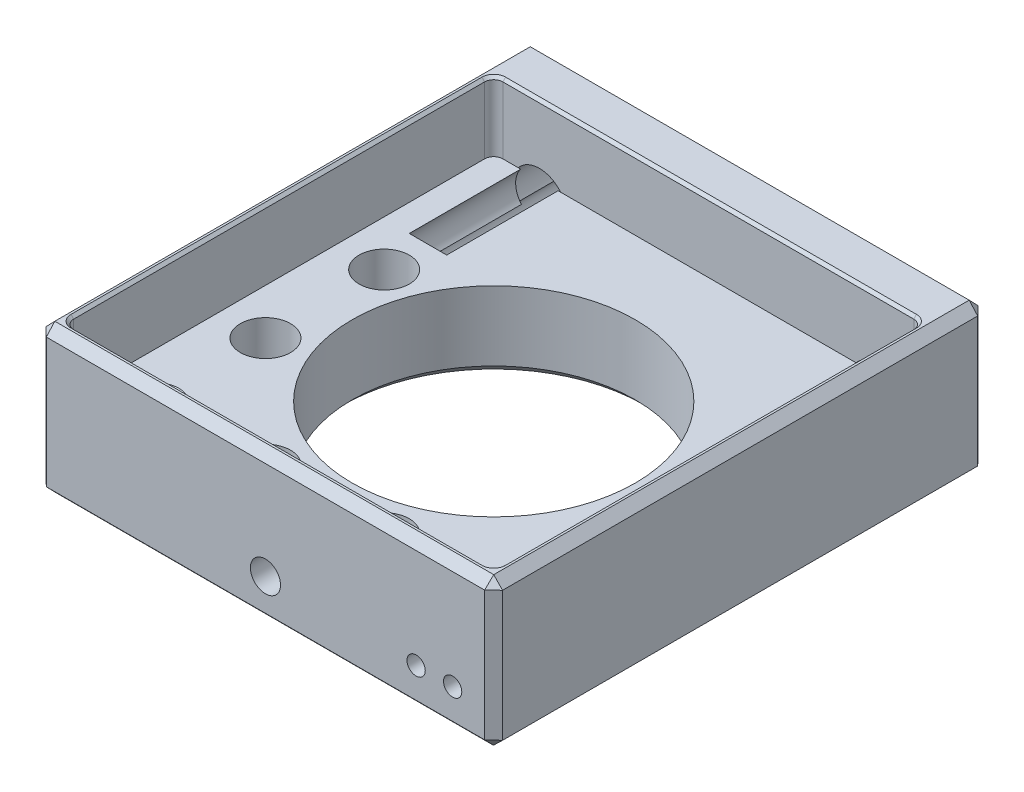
from build123d import *
from OCP.BRepFilletAPI import BRepFilletAPI_MakeChamfer

# Parameters (mm, degrees)
SKETCH_1_W                  = 50
SKETCH_1_H                  = 54
EXTRUDE_1_DEPTH             = 16.2
SKETCH_2_W                  = 47
SKETCH_2_H                  = 47
CUT_EXTRUDE_1_DEPTH         = 7.6
CUT_EXTRUDE_2_REACH         = 39.788
SKETCH_3_R                  = 15.5
HOLE_WIZARD_5_5_5_5_1_D     = 5.5
CUT_EXTRUDE_4_DEPTH         = 2.6
HOLE_WIZARD_M4_1_D          = 3.3
HOLE_WIZARD_M4_1_DEPTH      = 7
HOLE_WIZARD_M4_1_TIP        = 0.991420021
HOLE_WIZARD_M4_2_D          = 3.3
HOLE_WIZARD_M4_2_DEPTH      = 7
HOLE_WIZARD_M4_2_TIP        = 0.991420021
F_6_0MM_1_D                 = 6
F_6_0MM_1_DEPTH             = 5.5
SKETCH_25_R                 = 1
CUT_EXTRUDE_10_DEPTH        = 14
CHAMFER_1_SIZE              = 1
HOLE_WIZARD_5_2_5_2_1_D     = 5.2
HOLE_WIZARD_5_2_5_2_1_DEPTH = 49.5
HOLE_WIZARD_5_2_5_2_2_D     = 5.2
HOLE_WIZARD_5_2_5_2_2_DEPTH = 17.7
SKETCH_24_R                 = 1
CUT_EXTRUDE_9_DEPTH         = 18.5
FILLET_1_R                  = 1
CHAMFER_4_SIZE              = 1
CHAMFER_4_SIZE2             = 0.965688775
CHAMFER_5_SIZE              = 0.3


with BuildPart() as part:
    # Sketch 1 → Extrude 1 (new body)
    with BuildSketch(Plane(origin=(0, 0, 0), x_dir=(1, 0, 0), z_dir=(0, 1, 0))):
        Rectangle(SKETCH_1_W, SKETCH_1_H)
    extrude(amount=EXTRUDE_1_DEPTH)

    # Sketch 2 → Cut-Extrude 1 (cut)
    with BuildSketch(Plane(origin=(0, 16.2, 0), x_dir=(1, 0, 0), z_dir=(0, 1, 0))):
        with Locations((0, -2)):
            Rectangle(SKETCH_2_W, SKETCH_2_H)
    extrude(amount=-CUT_EXTRUDE_1_DEPTH, mode=Mode.SUBTRACT)

    # Sketch 3 → Cut-Extrude 2 (cut, up to next)
    with BuildSketch(Plane(origin=(0, 8.6, 0), x_dir=(1, 0, 0), z_dir=(0, 1, 0)), mode=Mode.PRIVATE) as cut_extrude_2_sk1:
        with Locations(Location((0, -2, 0), (0, 0, 270))):
            Circle(SKETCH_3_R)
    cut_extrude_2_tool1 = extrude(cut_extrude_2_sk1.sketch, amount=-CUT_EXTRUDE_2_REACH, mode=Mode.PRIVATE) & part.part
    add(cut_extrude_2_tool1.solids().sort_by_distance((0, 8.6, 2))[0], mode=Mode.SUBTRACT)

    # Hole Wizard 5.5 _5.5_ _1 (through all)
    with Locations(Plane(origin=(0, 8.6, 0), x_dir=(1, 0, 0), z_dir=(0, 1, 0))):
        with Locations((-18.5, 4.5), (-18.5, -8.5), (-6.5, -20.5), (6.5, -20.5)):
            Hole(HOLE_WIZARD_5_5_5_5_1_D / 2)

    # Sketch 9 → Cut-Extrude 4 (cut)
    with BuildSketch(Plane.XZ):
        with BuildLine():
            Line((-17.4, 12), (-17.4, -8))
            ThreePointArc((-17.4, -8), (-18.5, -9.1), (-19.6, -8))
            Line((-19.6, -8), (-19.6, 12))
            ThreePointArc((-19.6, 12), (-18.5, 13.1), (-17.4, 12))
        make_face()
        with BuildLine():
            Line((-10, 21.6), (10, 21.6))
            ThreePointArc((10, 21.6), (11.1, 20.5), (10, 19.4))
            Line((10, 19.4), (-10, 19.4))
            ThreePointArc((-10, 19.4), (-11.1, 20.5), (-10, 21.6))
        make_face()
    extrude(amount=-CUT_EXTRUDE_4_DEPTH, mode=Mode.SUBTRACT)

    # Hole Wizard M4 _1
    with Locations(Plane.ZY.offset(25)):
        with Locations((0, 4.5)):
            Hole(HOLE_WIZARD_M4_1_D / 2, depth=HOLE_WIZARD_M4_1_DEPTH)
            with Locations((0, 0, -(HOLE_WIZARD_M4_1_DEPTH + HOLE_WIZARD_M4_1_TIP / 2))):  # 118° drill point
                Cone(0, HOLE_WIZARD_M4_1_D / 2, HOLE_WIZARD_M4_1_TIP, mode=Mode.SUBTRACT)

    # Hole Wizard M4 _2
    with Locations(Plane.XY.offset(27)):
        with Locations((0, 4.5)):
            Hole(HOLE_WIZARD_M4_2_D / 2, depth=HOLE_WIZARD_M4_2_DEPTH)
            with Locations((0, 0, -(HOLE_WIZARD_M4_2_DEPTH + HOLE_WIZARD_M4_2_TIP / 2))):  # 118° drill point
                Cone(0, HOLE_WIZARD_M4_2_D / 2, HOLE_WIZARD_M4_2_TIP, mode=Mode.SUBTRACT)

    # 6.0mm _1
    with Locations(Plane(origin=(0, 0, -27), x_dir=(-1, 0, 0), z_dir=(0, 0, -1))):
        with Locations((18.5, 6.7), (-18.5, 6.7)):
            Hole(F_6_0MM_1_D / 2, depth=F_6_0MM_1_DEPTH)

    # Sketch 25 → Cut-Extrude 10 (cut)
    with BuildSketch(Plane.XY.offset(27)):
        with Locations((16.5, 4.3)):
            Circle(SKETCH_25_R)
        with Locations((20.5, 4.3)):
            Circle(SKETCH_25_R)
    extrude(amount=-CUT_EXTRUDE_10_DEPTH, mode=Mode.SUBTRACT)

    # Chamfer 1
    chamfer_1_edges = [part.edges().sort_by_distance(p)[0] for p in [
        (0, 0, -13.5),
    ]]
    chamfer(chamfer_1_edges, length=CHAMFER_1_SIZE)

    # Sketch 26 → Cut-Revolve 1 (revolve, cut)
    with BuildSketch(Plane.XY.offset(20.5), mode=Mode.PRIVATE) as cut_revolve_1_sk:
        Polygon((-18.5, 8.6), (-18.5, 6.1), (-16, 8.6), align=None)
    revolve(cut_revolve_1_sk.sketch.rotate(Axis((-18.5, 8.6, 20.5), (0, -1, 0)), 180), axis=Axis((-18.5, 8.6, 20.5), (0, -1, 0)), mode=Mode.SUBTRACT)

    # Hole Wizard 5.2 _5.2_ _1
    with Locations(Plane(origin=(0, 0, -27), x_dir=(-1, 0, 0), z_dir=(0, 0, -1))):
        with Locations((-18.5, 7)):
            Hole(HOLE_WIZARD_5_2_5_2_1_D / 2, depth=HOLE_WIZARD_5_2_5_2_1_DEPTH)

    # Hole Wizard 5.2 _5.2_ _2
    with Locations(Plane(origin=(0, 0, -27), x_dir=(-1, 0, 0), z_dir=(0, 0, -1))):
        with Locations((18.5, 7)):
            Hole(HOLE_WIZARD_5_2_5_2_2_D / 2, depth=HOLE_WIZARD_5_2_5_2_2_DEPTH)

    # Sketch 24 → Cut-Extrude 9 (cut)
    with BuildSketch(Plane(origin=(0, 0, -27), x_dir=(-1, 0, 0), z_dir=(0, 0, -1))):
        with Locations((16.5, 4.3)):
            Circle(SKETCH_24_R)
        with Locations((20.5, 4.3)):
            Circle(SKETCH_24_R)
    extrude(amount=-CUT_EXTRUDE_9_DEPTH, mode=Mode.SUBTRACT)

    # Fillet 1
    fillet_1_edges = [part.edges().sort_by_distance(p)[0] for p in [
        (-23.5, 12.4, 25.5),
        (-23.5, 12.4, -21.5),
        (23.5, 12.4, -21.5),
        (23.5, 12.4, 25.5),
    ]]
    fillet(fillet_1_edges, radius=FILLET_1_R)

    # Chamfer 4: one chamfer whose edges measure the first distance from different faces: ONE call of the kernel's chamfer builder (chamfer() names one face for all edges)
    chamfer_4_edges_1 = [part.edges().sort_by_distance(p)[0] for p in [
        (-25, 16.2, 0),
    ]]
    chamfer_4_side_1 = [part.faces().sort_by_distance(p)[0] for p in [
        (-25, 8.135544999, 0),
    ]]
    chamfer_4_edges_2 = [part.edges().sort_by_distance(p)[0] for p in [
        (0, 16.2, 27),
        (0, 0, 27),
        (25, 8.1, 27),
        (-25, 8.1, 27),
    ]]
    chamfer_4_side_2 = [part.faces().sort_by_distance(p)[0] for p in [
        (-0.146182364, 8.168749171, 27),
    ]]
    chamfer_4_edges_3 = [part.edges().sort_by_distance(p)[0] for p in [
        (25, 16.2, 0),
        (25, 8.1, -27),
    ]]
    chamfer_4_side_3 = [part.faces().sort_by_distance(p)[0] for p in [
        (25, 8.1, 0),
    ]]
    chamfer_4_edges_4 = [part.edges().sort_by_distance(p)[0] for p in [
        (-25, 0, 0),
        (0, 0, -27),
        (25, 0, 0),
    ]]
    chamfer_4_side_4 = [part.faces().sort_by_distance(p)[0] for p in [
        (0, 0, -15.23593478),
    ]]
    chamfer_4_edges_5 = [part.edges().sort_by_distance(p)[0] for p in [
        (-25, 8.1, -27),
        (0, 16.2, -27),
    ]]
    chamfer_4_side_5 = [part.faces().sort_by_distance(p)[0] for p in [
        (0.094964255, 8.226417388, -27),
    ]]
    chamfer_4 = BRepFilletAPI_MakeChamfer(part.part.solid().wrapped)
    for e in chamfer_4_edges_1:
        chamfer_4.Add(CHAMFER_4_SIZE, CHAMFER_4_SIZE2, e.wrapped, chamfer_4_side_1[0].wrapped)  # the first distance lies on this face
    for e in chamfer_4_edges_2:
        chamfer_4.Add(CHAMFER_4_SIZE, CHAMFER_4_SIZE2, e.wrapped, chamfer_4_side_2[0].wrapped)  # the first distance lies on this face
    for e in chamfer_4_edges_3:
        chamfer_4.Add(CHAMFER_4_SIZE, CHAMFER_4_SIZE2, e.wrapped, chamfer_4_side_3[0].wrapped)  # the first distance lies on this face
    for e in chamfer_4_edges_4:
        chamfer_4.Add(CHAMFER_4_SIZE, CHAMFER_4_SIZE2, e.wrapped, chamfer_4_side_4[0].wrapped)  # the first distance lies on this face
    for e in chamfer_4_edges_5:
        chamfer_4.Add(CHAMFER_4_SIZE, CHAMFER_4_SIZE2, e.wrapped, chamfer_4_side_5[0].wrapped)  # the first distance lies on this face
    add(Compound.cast(chamfer_4.Shape()), mode=Mode.REPLACE)

    # Chamfer 5
    chamfer_5_edges = [part.edges().sort_by_distance(p)[0] for p in [
        (0, 0, 19.4),
        (0, 0, 21.6),
        (9.510208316, 0, 21.6),
        (9.510208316, 0, 19.4),
        (11.1, 0, 20.5),
        (-9.510208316, 0, 19.4),
        (-9.510208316, 0, 21.6),
        (-11.1, 0, 20.5),
        (15.5, 6.7, -27),
        (-18.5, 3.7, -27),
        (-18.5, 9.7, -27),
        (-15.8598156, 3.53177872, -27),
        (-20.703171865, 3.320856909, -27),
        (0, 16.2, -21.5),
        (23.5, 16.2, 2),
        (0, 16.2, 25.5),
        (-23.5, 16.2, 2),
        (23.207106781, 16.2, -21.207106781),
        (23.207106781, 16.2, 25.207106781),
        (-23.207106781, 16.2, -21.207106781),
        (-23.207106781, 16.2, 25.207106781),
        (-15.75, 0, 8.5),
        (-15.75, 0, -4.5),
        (-20.800815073, 0, -6.006237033),
        (-20.800815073, 0, 6.993762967),
        (-6.5, 0, 17.75),
        (-6.5, 0, 23.25),
        (6.5, 0, 17.75),
        (6.5, 0, 23.25),
        (-19.6, 0, 11.510208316),
        (-17.4, 0, 11.510208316),
        (-18.5, 0, 13.1),
        (-17.4, 0, 2),
        (-19.6, 0, 2),
        (-17.4, 0, -7.510208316),
        (-19.6, 0, -7.510208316),
        (-18.5, 0, -9.1),
    ]]
    chamfer(chamfer_5_edges, length=CHAMFER_5_SIZE)


solid = part.part
